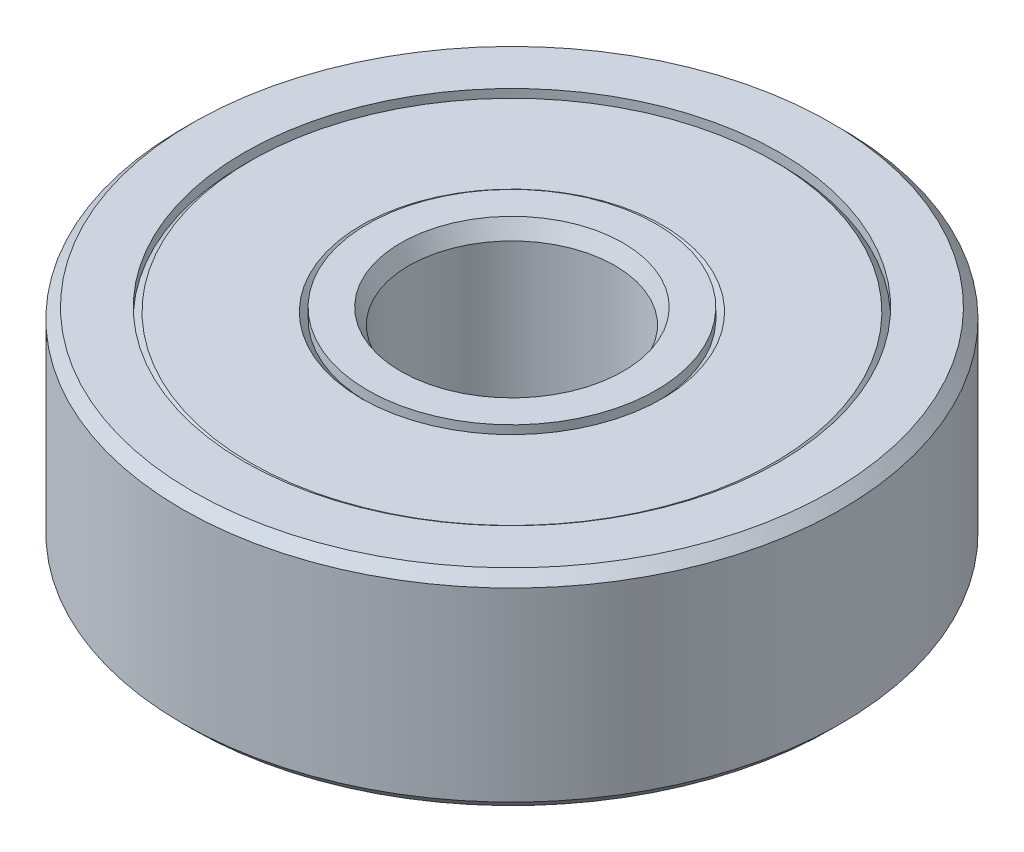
from build123d import *

# Parameters (mm, degrees)
SKETCH_1_R        = 3.5
SKETCH_1_R_2      = 2.5
EXTRUDE_1_DEPTH   = 5
SKETCH_1_R_3      = 8
SKETCH_1_R_4      = 6.5
EXTRUDE_1_2_DEPTH = 5
EXTRUDE_START     = 0.1
SKETCH_1_3_R      = 6.5
SKETCH_1_3_R_2    = 3.5
EXTRUDE_2_DEPTH   = 4.8
CHAMFER_1_SIZE    = 0.25
CHAMFER_2_SIZE    = 0.2
CHAMFER_2_SIZE2   = 0.376145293
CHAMFER_3_SIZE    = 0.15
CHAMFER_4_SIZE    = 0.2
CHAMFER_4_SIZE2   = 0.376145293


with BuildPart() as part:
    # Sketch 1 → Extrude 1 (new body)
    with BuildSketch(Plane(origin=(0, 0, 0), x_dir=(1, 0, 0), z_dir=(0, 1, 0))):
        with Locations(Location((0, 0, 0), (0, 0, 270))):
            Circle(SKETCH_1_R)
        with Locations(Location((0, 0, 0), (0, 0, 270))):
            Circle(SKETCH_1_R_2, mode=Mode.SUBTRACT)
    extrude(amount=EXTRUDE_1_DEPTH)

    # Chamfer 2
    chamfer_2_edges = [part.edges().sort_by_distance(p)[0] for p in [
        (0, 5, -2.5),
    ]]
    chamfer_2_side = [part.faces().sort_by_distance(p)[0] for p in [
        (0, 5, -3.401005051),
    ]]
    chamfer(chamfer_2_edges, length=CHAMFER_2_SIZE, length2=CHAMFER_2_SIZE2, reference=chamfer_2_side[0])

    # Chamfer 4
    chamfer_4_edges = [part.edges().sort_by_distance(p)[0] for p in [
        (0, 0, -2.5),
    ]]
    chamfer_4_side = [part.faces().sort_by_distance(p)[0] for p in [
        (0, 0, -3.401005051),
    ]]
    chamfer(chamfer_4_edges, length=CHAMFER_4_SIZE, length2=CHAMFER_4_SIZE2, reference=chamfer_4_side[0])


with BuildPart() as body_2:
    # Sketch 1 → Extrude 1 2 (new body)
    with BuildSketch(Plane(origin=(0, 0, 0), x_dir=(1, 0, 0), z_dir=(0, 1, 0))):
        with Locations(Location((0, 0, 0), (0, 0, 270))):
            Circle(SKETCH_1_R_3)
        with Locations(Location((0, 0, 0), (0, 0, 270))):
            Circle(SKETCH_1_R_4, mode=Mode.SUBTRACT)
    extrude(amount=EXTRUDE_1_2_DEPTH)

    # Chamfer 1
    chamfer_1_edges = [body_2.edges().sort_by_distance(p)[0] for p in [
        (0, 0, -8),
        (0, 5, -8),
    ]]
    chamfer(chamfer_1_edges, length=CHAMFER_1_SIZE)


with BuildPart() as body_3:
    # Sketch 1_3 → Extrude 2 (new body)
    with BuildSketch(Plane(origin=(0, 0, 0), x_dir=(1, 0, 0), z_dir=(0, 1, 0)).offset(EXTRUDE_START)):
        with Locations(Location((0, 0, 0), (0, 0, 270))):
            Circle(SKETCH_1_3_R)
        with Locations(Location((0, 0, 0), (0, 0, 270))):
            Circle(SKETCH_1_3_R_2, mode=Mode.SUBTRACT)
    extrude(amount=EXTRUDE_2_DEPTH)

    # Chamfer 3
    chamfer_3_edges = [body_3.edges().sort_by_distance(p)[0] for p in [
        (0, 4.9, -6.5),
        (0, 0.1, -6.5),
        (0, 0.1, -3.5),
        (0, 4.9, -3.5),
    ]]
    chamfer(chamfer_3_edges, length=CHAMFER_3_SIZE)


solid = Compound([part.part, body_2.part, body_3.part])
